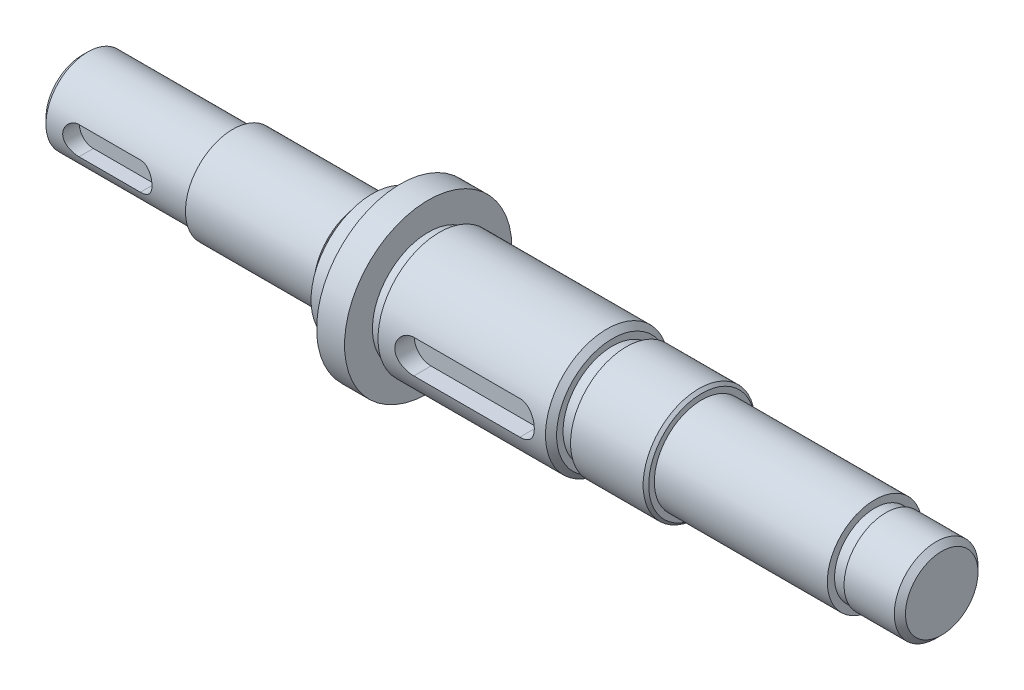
from build123d import *

# Parameters (mm, degrees)
SKETCH_4_R          = 7.5
EXTRUDE_1_DEPTH     = 27
SKETCH_7_R          = 8.5
EXTRUDE_2_DEPTH     = 23
SKETCH_8_R          = 8.2
EXTRUDE_3_DEPTH     = 2
SKETCH_9_R          = 11
EXTRUDE_4_DEPTH     = 5
SKETCH_10_R         = 15
EXTRUDE_5_DEPTH     = 5
SKETCH_11_R         = 10
EXTRUDE_6_DEPTH     = 2
SKETCH_12_R         = 11
EXTRUDE_7_DEPTH     = 31
SKETCH_13_R         = 8.85
EXTRUDE_8_DEPTH     = 2.5
SKETCH_14_R         = 10
EXTRUDE_9_DEPTH     = 13.5
SKETCH_15_R         = 8.5
EXTRUDE_10_DEPTH    = 31
SKETCH_16_R         = 7.2
EXTRUDE_11_DEPTH    = 2
SKETCH_17_R         = 7.5
EXTRUDE_12_DEPTH    = 10
CUT_EXTRUDE_1_DEPTH = 3
CHAMFER_1_SIZE      = 1
CHAMFER_2_SIZE      = 1
CHAMFER_3_SIZE      = 0.5
CUT_EXTRUDE_2_DEPTH = 3.5


with BuildPart() as part:
    # Sketch 4 → Extrude 1 (new body)
    with BuildSketch(Plane(origin=(0, 0, 0), x_dir=(0, 0, -1), z_dir=(1, 0, 0))):
        Circle(SKETCH_4_R)
    extrude(amount=EXTRUDE_1_DEPTH)

    # Sketch 7 → Extrude 2 (add)
    with BuildSketch(Plane(origin=(27, 0, 0), x_dir=(0, 0, -1), z_dir=(1, 0, 0))):
        Circle(SKETCH_7_R)
    extrude(amount=EXTRUDE_2_DEPTH)

    # Sketch 8 → Extrude 3 (add)
    with BuildSketch(Plane(origin=(50, 0, 0), x_dir=(0, 0, -1), z_dir=(1, 0, 0))):
        Circle(SKETCH_8_R)
    extrude(amount=EXTRUDE_3_DEPTH)

    # Sketch 9 → Extrude 4 (add)
    with BuildSketch(Plane(origin=(52, 0, 0), x_dir=(0, 0, -1), z_dir=(1, 0, 0))):
        Circle(SKETCH_9_R)
    extrude(amount=EXTRUDE_4_DEPTH)

    # Sketch 10 → Extrude 5 (add)
    with BuildSketch(Plane(origin=(57, 0, 0), x_dir=(0, 0, -1), z_dir=(1, 0, 0))):
        Circle(SKETCH_10_R)
    extrude(amount=EXTRUDE_5_DEPTH)

    # Sketch 11 → Extrude 6 (add)
    with BuildSketch(Plane(origin=(62, 0, 0), x_dir=(0, 0, -1), z_dir=(1, 0, 0))):
        Circle(SKETCH_11_R)
    extrude(amount=EXTRUDE_6_DEPTH)

    # Sketch 12 → Extrude 7 (add)
    with BuildSketch(Plane(origin=(64, 0, 0), x_dir=(0, 0, -1), z_dir=(1, 0, 0))):
        Circle(SKETCH_12_R)
    extrude(amount=EXTRUDE_7_DEPTH)

    # Sketch 13 → Extrude 8 (add)
    with BuildSketch(Plane(origin=(95, 0, 0), x_dir=(0, 0, -1), z_dir=(1, 0, 0))):
        Circle(SKETCH_13_R)
    extrude(amount=EXTRUDE_8_DEPTH)

    # Sketch 14 → Extrude 9 (add)
    with BuildSketch(Plane(origin=(97.5, 0, 0), x_dir=(0, 0, -1), z_dir=(1, 0, 0))):
        Circle(SKETCH_14_R)
    extrude(amount=EXTRUDE_9_DEPTH)

    # Sketch 15 → Extrude 10 (add)
    with BuildSketch(Plane(origin=(111, 0, 0), x_dir=(0, 0, -1), z_dir=(1, 0, 0))):
        Circle(SKETCH_15_R)
    extrude(amount=EXTRUDE_10_DEPTH)

    # Sketch 16 → Extrude 11 (add)
    with BuildSketch(Plane(origin=(142, 0, 0), x_dir=(0, 0, -1), z_dir=(1, 0, 0))):
        Circle(SKETCH_16_R)
    extrude(amount=EXTRUDE_11_DEPTH)

    # Sketch 17 → Extrude 12 (add)
    with BuildSketch(Plane(origin=(144, 0, 0), x_dir=(0, 0, -1), z_dir=(1, 0, 0))):
        Circle(SKETCH_17_R)
    extrude(amount=EXTRUDE_12_DEPTH)

    # Sketch 18 → Cut-Extrude 1 (cut)
    with BuildSketch(Plane.XY.offset(7.5)):
        with BuildLine():
            Line((6.5, 2.5), (17.5, 2.5))
            ThreePointArc((17.5, 2.5), (20, 0), (17.5, -2.5))
            Line((17.5, -2.5), (6.5, -2.5))
            ThreePointArc((6.5, -2.5), (4, 0), (6.5, 2.5))
        make_face()
    extrude(amount=-CUT_EXTRUDE_1_DEPTH, mode=Mode.SUBTRACT)

    # Chamfer 1
    chamfer_1_edges = [part.edges().sort_by_distance(p)[0] for p in [
        (0, 0, 7.5),
    ]]
    chamfer(chamfer_1_edges, length=CHAMFER_1_SIZE)

    # Chamfer 2
    chamfer_2_edges = [part.edges().sort_by_distance(p)[0] for p in [
        (95, 0, 11),
        (154, 0, 7.5),
    ]]
    chamfer(chamfer_2_edges, length=CHAMFER_2_SIZE)

    # Chamfer 3
    chamfer_3_edges = [part.edges().sort_by_distance(p)[0] for p in [
        (111, 0, 10),
    ]]
    chamfer(chamfer_3_edges, length=CHAMFER_3_SIZE)

    # Sketch 20 → Cut-Extrude 2 (cut)
    with BuildSketch(Plane.XY.offset(11)):
        with BuildLine():
            Line((70, 3), (89, 3))
            ThreePointArc((89, 3), (92, 0), (89, -3))
            Line((89, -3), (70, -3))
            ThreePointArc((70, -3), (67, 0), (70, 3))
        make_face()
    extrude(amount=-CUT_EXTRUDE_2_DEPTH, mode=Mode.SUBTRACT)


solid = part.part
